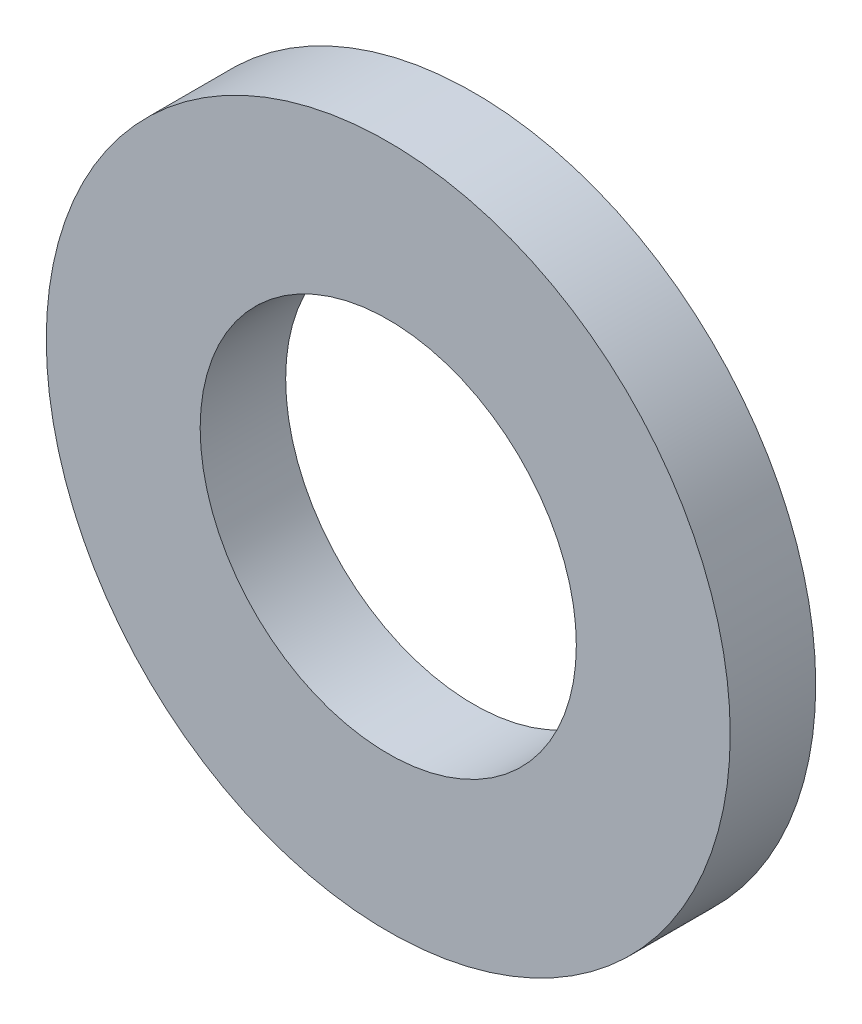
from build123d import *

# Parameters (mm, degrees)
ESQUISSE1_R      = 2
ESQUISSE1_R_2    = 1.1
EXTRUSION1_DEPTH = 0.5


with BuildPart() as part:
    # Esquisse1 → Extrusion1 (new body)
    with BuildSketch(Plane.XY):
        Circle(ESQUISSE1_R)
        Circle(ESQUISSE1_R_2, mode=Mode.SUBTRACT)
    extrude(amount=EXTRUSION1_DEPTH)


solid = part.part
